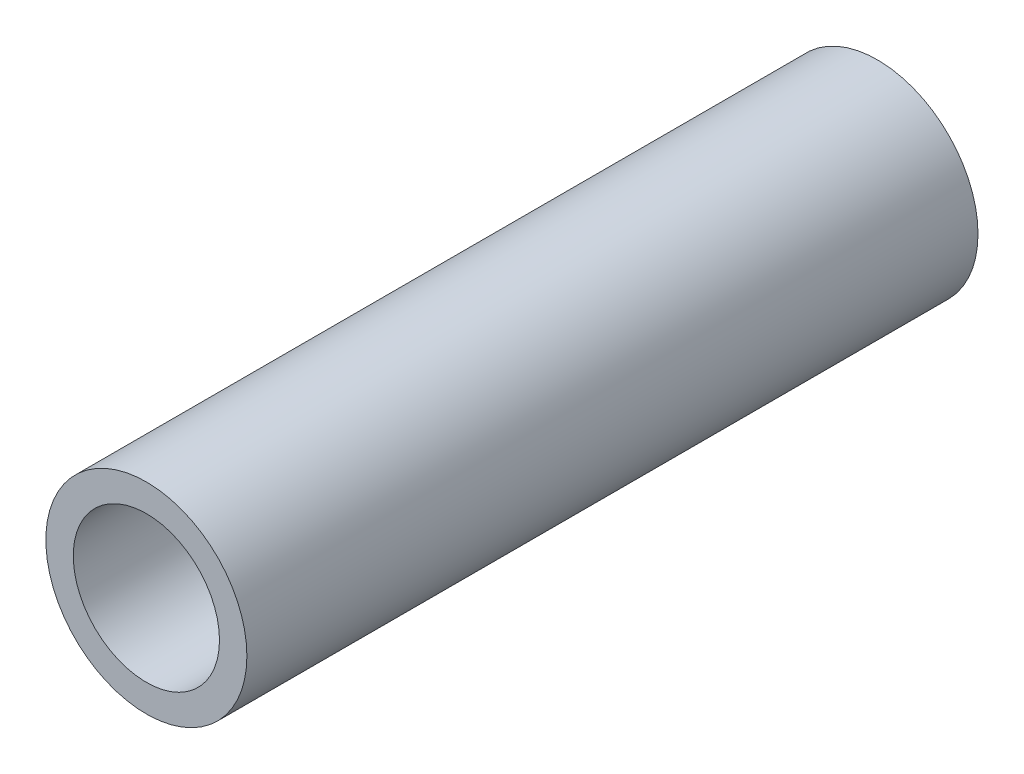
ISO-10303-21;
HEADER;
FILE_DESCRIPTION(('STEP AP214'),'2;1');
FILE_NAME('part.step','',(''),(''),'','','');
FILE_SCHEMA(('AUTOMOTIVE_DESIGN { 1 0 10303 214 1 1 1 1 }'));
ENDSEC;
DATA;
#1=APPLICATION_CONTEXT('core data for automotive mechanical design processes');
#2=APPLICATION_PROTOCOL_DEFINITION('international standard','automotive_design',2000,#1);
#3=PRODUCT_CONTEXT('',#1,'mechanical');
#4=PRODUCT('Part','Part','',(#3));
#5=PRODUCT_RELATED_PRODUCT_CATEGORY('part','',(#4));
#6=PRODUCT_DEFINITION_FORMATION('','',#4);
#7=PRODUCT_DEFINITION_CONTEXT('part definition',#1,'design');
#8=PRODUCT_DEFINITION('design','',#6,#7);
#9=PRODUCT_DEFINITION_SHAPE('','',#8);
#10=(LENGTH_UNIT() NAMED_UNIT(*) SI_UNIT(.MILLI.,.METRE.));
#11=(NAMED_UNIT(*) PLANE_ANGLE_UNIT() SI_UNIT($,.RADIAN.));
#12=(NAMED_UNIT(*) SI_UNIT($,.STERADIAN.) SOLID_ANGLE_UNIT());
#13=UNCERTAINTY_MEASURE_WITH_UNIT(LENGTH_MEASURE(1.E-05),#10,'distance_accuracy_value','');
#14=(GEOMETRIC_REPRESENTATION_CONTEXT(3) GLOBAL_UNCERTAINTY_ASSIGNED_CONTEXT((#13)) GLOBAL_UNIT_ASSIGNED_CONTEXT((#10,
#11,#12)) REPRESENTATION_CONTEXT('',''));
#15=CARTESIAN_POINT('',(0.,0.,0.));
#16=DIRECTION('',(0.,0.,1.));
#17=DIRECTION('',(1.,0.,0.));
#18=AXIS2_PLACEMENT_3D('',#15,#16,#17);
#19=CARTESIAN_POINT('',(0.,0.,50.8));
#20=DIRECTION('',(0.,0.,1.));
#21=DIRECTION('',(1.,0.,0.));
#22=AXIS2_PLACEMENT_3D('',#19,#20,#21);
#23=PLANE('',#22);
#24=CARTESIAN_POINT('',(0.,0.,50.8));
#25=DIRECTION('',(0.,0.,1.));
#26=DIRECTION('',(1.,0.,0.));
#27=AXIS2_PLACEMENT_3D('',#24,#25,#26);
#28=CIRCLE('',#27,6.985);
#29=CARTESIAN_POINT('',(6.985,0.,50.8));
#30=VERTEX_POINT('',#29);
#31=EDGE_CURVE('E10',#30,#30,#28,.T.);
#32=ORIENTED_EDGE('',*,*,#31,.T.);
#33=EDGE_LOOP('',(#32));
#34=FACE_BOUND('',#33,.T.);
#35=CARTESIAN_POINT('',(0.,0.,50.8));
#36=DIRECTION('',(0.,0.,1.));
#37=DIRECTION('',(1.,0.,0.));
#38=AXIS2_PLACEMENT_3D('',#35,#36,#37);
#39=CIRCLE('',#38,5.08);
#40=CARTESIAN_POINT('',(5.08,0.,50.8));
#41=VERTEX_POINT('',#40);
#42=EDGE_CURVE('E43',#41,#41,#39,.T.);
#43=ORIENTED_EDGE('',*,*,#42,.F.);
#44=EDGE_LOOP('',(#43));
#45=FACE_BOUND('',#44,.T.);
#46=ADVANCED_FACE('F32',(#34,#45),#23,.T.);
#47=CARTESIAN_POINT('',(0.,0.,0.));
#48=DIRECTION('',(0.,0.,1.));
#49=DIRECTION('',(1.,0.,0.));
#50=AXIS2_PLACEMENT_3D('',#47,#48,#49);
#51=PLANE('',#50);
#52=CARTESIAN_POINT('',(0.,0.,0.));
#53=DIRECTION('',(0.,0.,1.));
#54=DIRECTION('',(1.,0.,0.));
#55=AXIS2_PLACEMENT_3D('',#52,#53,#54);
#56=CIRCLE('',#55,6.985);
#57=CARTESIAN_POINT('',(6.985,0.,0.));
#58=VERTEX_POINT('',#57);
#59=EDGE_CURVE('E36',#58,#58,#56,.T.);
#60=ORIENTED_EDGE('',*,*,#59,.F.);
#61=EDGE_LOOP('',(#60));
#62=FACE_BOUND('',#61,.T.);
#63=CARTESIAN_POINT('',(0.,0.,0.));
#64=DIRECTION('',(0.,0.,1.));
#65=DIRECTION('',(1.,0.,0.));
#66=AXIS2_PLACEMENT_3D('',#63,#64,#65);
#67=CIRCLE('',#66,5.08);
#68=CARTESIAN_POINT('',(5.08,0.,0.));
#69=VERTEX_POINT('',#68);
#70=EDGE_CURVE('E45',#69,#69,#67,.T.);
#71=ORIENTED_EDGE('',*,*,#70,.T.);
#72=EDGE_LOOP('',(#71));
#73=FACE_BOUND('',#72,.T.);
#74=ADVANCED_FACE('F55',(#62,#73),#51,.F.);
#75=CARTESIAN_POINT('',(0.,0.,50.8));
#76=DIRECTION('',(0.,0.,-1.));
#77=DIRECTION('',(-1.,0.,0.));
#78=AXIS2_PLACEMENT_3D('',#75,#76,#77);
#79=CYLINDRICAL_SURFACE('',#78,6.985);
#80=ORIENTED_EDGE('',*,*,#31,.F.);
#81=EDGE_LOOP('',(#80));
#82=FACE_BOUND('',#81,.T.);
#83=ORIENTED_EDGE('',*,*,#59,.T.);
#84=EDGE_LOOP('',(#83));
#85=FACE_BOUND('',#84,.T.);
#86=ADVANCED_FACE('F34',(#82,#85),#79,.T.);
#87=CARTESIAN_POINT('',(0.,0.,50.8));
#88=DIRECTION('',(0.,0.,-1.));
#89=DIRECTION('',(-1.,0.,0.));
#90=AXIS2_PLACEMENT_3D('',#87,#88,#89);
#91=CYLINDRICAL_SURFACE('',#90,5.08);
#92=ORIENTED_EDGE('',*,*,#42,.T.);
#93=EDGE_LOOP('',(#92));
#94=FACE_BOUND('',#93,.T.);
#95=ORIENTED_EDGE('',*,*,#70,.F.);
#96=EDGE_LOOP('',(#95));
#97=FACE_BOUND('',#96,.T.);
#98=ADVANCED_FACE('F51',(#94,#97),#91,.F.);
#99=CLOSED_SHELL('',(#46,#74,#86,#98));
#100=MANIFOLD_SOLID_BREP('B2',#99);
#101=ADVANCED_BREP_SHAPE_REPRESENTATION('',(#18,#100),#14);
#102=SHAPE_DEFINITION_REPRESENTATION(#9,#101);
ENDSEC;
END-ISO-10303-21;
